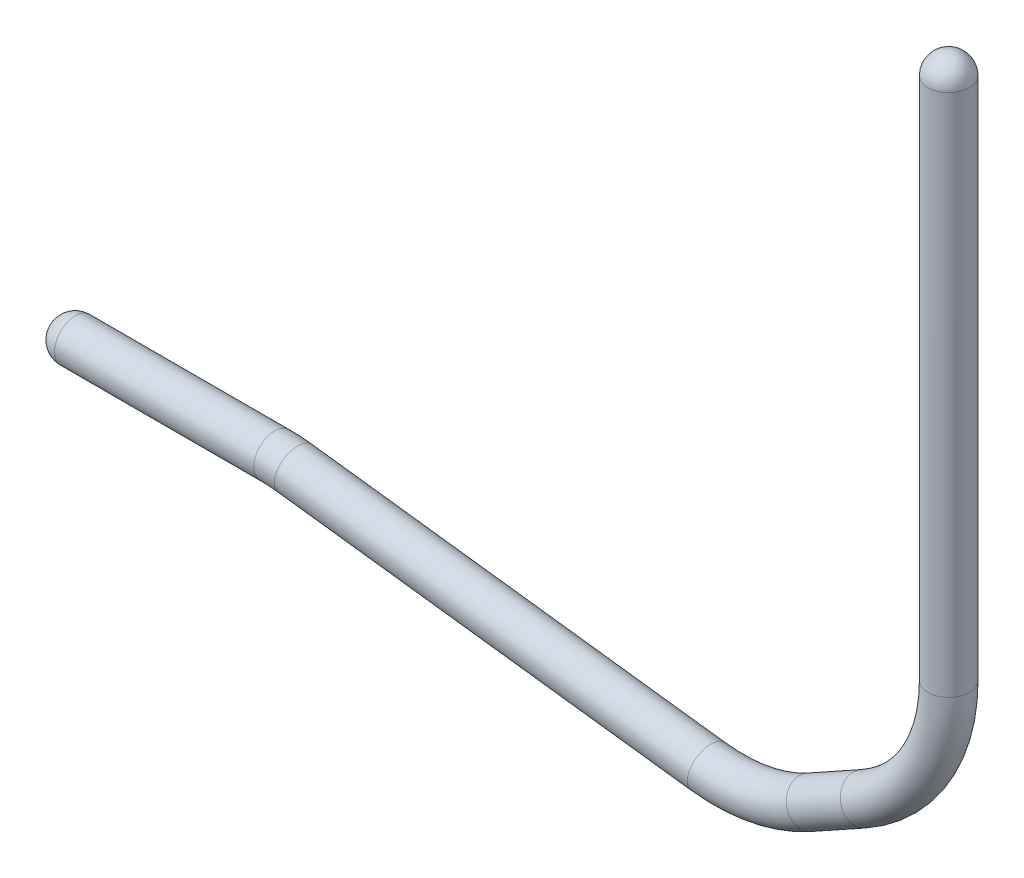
ISO-10303-21;
HEADER;
FILE_DESCRIPTION(('STEP AP214'),'2;1');
FILE_NAME('part.step','',(''),(''),'','','');
FILE_SCHEMA(('AUTOMOTIVE_DESIGN { 1 0 10303 214 1 1 1 1 }'));
ENDSEC;
DATA;
#1=APPLICATION_CONTEXT('core data for automotive mechanical design processes');
#2=APPLICATION_PROTOCOL_DEFINITION('international standard','automotive_design',2000,#1);
#3=PRODUCT_CONTEXT('',#1,'mechanical');
#4=PRODUCT('Part','Part','',(#3));
#5=PRODUCT_RELATED_PRODUCT_CATEGORY('part','',(#4));
#6=PRODUCT_DEFINITION_FORMATION('','',#4);
#7=PRODUCT_DEFINITION_CONTEXT('part definition',#1,'design');
#8=PRODUCT_DEFINITION('design','',#6,#7);
#9=PRODUCT_DEFINITION_SHAPE('','',#8);
#10=(LENGTH_UNIT() NAMED_UNIT(*) SI_UNIT(.MILLI.,.METRE.));
#11=(NAMED_UNIT(*) PLANE_ANGLE_UNIT() SI_UNIT($,.RADIAN.));
#12=(NAMED_UNIT(*) SI_UNIT($,.STERADIAN.) SOLID_ANGLE_UNIT());
#13=UNCERTAINTY_MEASURE_WITH_UNIT(LENGTH_MEASURE(1.E-05),#10,'distance_accuracy_value','');
#14=(GEOMETRIC_REPRESENTATION_CONTEXT(3) GLOBAL_UNCERTAINTY_ASSIGNED_CONTEXT((#13)) GLOBAL_UNIT_ASSIGNED_CONTEXT((#10,
#11,#12)) REPRESENTATION_CONTEXT('',''));
#15=CARTESIAN_POINT('',(0.,0.,0.));
#16=DIRECTION('',(0.,0.,1.));
#17=DIRECTION('',(1.,0.,0.));
#18=AXIS2_PLACEMENT_3D('',#15,#16,#17);
#19=CARTESIAN_POINT('',(0.,-63.1194330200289,0.));
#20=DIRECTION('',(0.,1.,0.));
#21=DIRECTION('',(0.,0.,-1.));
#22=AXIS2_PLACEMENT_3D('',#19,#20,#21);
#23=CYLINDRICAL_SURFACE('',#22,2.5);
#24=CARTESIAN_POINT('',(0.,0.,0.));
#25=DIRECTION('',(0.,1.,0.));
#26=DIRECTION('',(-1.,0.,0.));
#27=AXIS2_PLACEMENT_3D('',#24,#25,#26);
#28=CIRCLE('',#27,2.5);
#29=CARTESIAN_POINT('',(0.,0.,-2.5));
#30=VERTEX_POINT('',#29);
#31=CARTESIAN_POINT('',(0.,0.,2.5));
#32=VERTEX_POINT('',#31);
#33=EDGE_CURVE('E59',#30,#32,#28,.T.);
#34=ORIENTED_EDGE('',*,*,#33,.F.);
#35=CARTESIAN_POINT('',(0.,0.,0.));
#36=DIRECTION('',(0.,-1.,0.));
#37=DIRECTION('',(1.,0.,0.));
#38=AXIS2_PLACEMENT_3D('',#35,#36,#37);
#39=CIRCLE('',#38,2.5);
#40=EDGE_CURVE('E37',#30,#32,#39,.T.);
#41=ORIENTED_EDGE('',*,*,#40,.T.);
#42=EDGE_LOOP('',(#34,#41));
#43=FACE_BOUND('',#42,.T.);
#44=CARTESIAN_POINT('',(0.,-63.1194330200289,0.));
#45=DIRECTION('',(0.,-1.,0.));
#46=DIRECTION('',(1.,0.,0.));
#47=AXIS2_PLACEMENT_3D('',#44,#45,#46);
#48=CIRCLE('',#47,2.5);
#49=CARTESIAN_POINT('',(2.5,-63.1194330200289,0.));
#50=VERTEX_POINT('',#49);
#51=EDGE_CURVE('E11',#50,#50,#48,.T.);
#52=ORIENTED_EDGE('',*,*,#51,.F.);
#53=EDGE_LOOP('',(#52));
#54=FACE_BOUND('',#53,.T.);
#55=ADVANCED_FACE('F16',(#43,#54),#23,.T.);
#56=CARTESIAN_POINT('',(-20.,-63.1194330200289,0.));
#57=DIRECTION('',(0.,0.,-1.));
#58=DIRECTION('',(1.,0.,0.));
#59=AXIS2_PLACEMENT_3D('',#56,#57,#58);
#60=TOROIDAL_SURFACE('',#59,20.,2.5);
#61=CARTESIAN_POINT('',(-10.2871413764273,-80.6025785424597,0.));
#62=DIRECTION('',(-0.874157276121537,-0.485642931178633,0.));
#63=DIRECTION('',(-0.485642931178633,0.874157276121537,0.));
#64=AXIS2_PLACEMENT_3D('',#61,#62,#63);
#65=CIRCLE('',#64,2.5);
#66=CARTESIAN_POINT('',(-9.07303404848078,-82.7879717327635,0.));
#67=VERTEX_POINT('',#66);
#68=EDGE_CURVE('E24',#67,#67,#65,.T.);
#69=CARTESIAN_POINT('',(-20.,-63.1194330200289,0.));
#70=DIRECTION('',(0.,0.,-1.));
#71=DIRECTION('',(1.,0.,0.));
#72=AXIS2_PLACEMENT_3D('',#69,#70,#71);
#73=CIRCLE('',#72,22.5);
#74=EDGE_CURVE('',#50,#67,#73,.T.);
#75=ORIENTED_EDGE('',*,*,#51,.T.);
#76=ORIENTED_EDGE('',*,*,#68,.F.);
#77=ORIENTED_EDGE('',*,*,#74,.T.);
#78=ORIENTED_EDGE('',*,*,#74,.F.);
#79=EDGE_LOOP('',(#75,#77,#76,#78));
#80=FACE_BOUND('',#79,.T.);
#81=ADVANCED_FACE('F91',(#80),#60,.T.);
#82=CARTESIAN_POINT('',(-16.7890684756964,-84.2147602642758,0.));
#83=DIRECTION('',(0.874157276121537,0.485642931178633,0.));
#84=DIRECTION('',(0.,0.,-1.));
#85=AXIS2_PLACEMENT_3D('',#82,#83,#84);
#86=CYLINDRICAL_SURFACE('',#85,2.5);
#87=ORIENTED_EDGE('',*,*,#68,.T.);
#88=EDGE_LOOP('',(#87));
#89=FACE_BOUND('',#88,.T.);
#90=CARTESIAN_POINT('',(-16.7890684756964,-84.2147602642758,0.));
#91=DIRECTION('',(-0.874157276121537,-0.485642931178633,0.));
#92=DIRECTION('',(-0.485642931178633,0.874157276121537,0.));
#93=AXIS2_PLACEMENT_3D('',#90,#91,#92);
#94=CIRCLE('',#93,2.5);
#95=CARTESIAN_POINT('',(-15.5749611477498,-86.4001534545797,0.));
#96=VERTEX_POINT('',#95);
#97=EDGE_CURVE('E75',#96,#96,#94,.T.);
#98=ORIENTED_EDGE('',*,*,#97,.F.);
#99=EDGE_LOOP('',(#98));
#100=FACE_BOUND('',#99,.T.);
#101=ADVANCED_FACE('F88',(#89,#100),#86,.T.);
#102=CARTESIAN_POINT('',(-26.501927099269,-66.7316147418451,0.));
#103=DIRECTION('',(0.,0.,-1.));
#104=DIRECTION('',(1.,0.,0.));
#105=AXIS2_PLACEMENT_3D('',#102,#103,#104);
#106=TOROIDAL_SURFACE('',#105,20.,2.5);
#107=CARTESIAN_POINT('',(-28.9826217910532,-86.5771722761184,0.));
#108=DIRECTION('',(-0.992277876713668,0.124034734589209,0.));
#109=DIRECTION('',(0.124034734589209,0.992277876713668,0.));
#110=AXIS2_PLACEMENT_3D('',#107,#108,#109);
#111=CIRCLE('',#110,2.5);
#112=CARTESIAN_POINT('',(-29.2927086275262,-89.0578669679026,0.));
#113=VERTEX_POINT('',#112);
#114=EDGE_CURVE('E71',#113,#113,#111,.T.);
#115=CARTESIAN_POINT('',(-26.501927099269,-66.7316147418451,0.));
#116=DIRECTION('',(0.,0.,-1.));
#117=DIRECTION('',(1.,0.,0.));
#118=AXIS2_PLACEMENT_3D('',#115,#116,#117);
#119=CIRCLE('',#118,22.5);
#120=EDGE_CURVE('',#96,#113,#119,.T.);
#121=ORIENTED_EDGE('',*,*,#97,.T.);
#122=ORIENTED_EDGE('',*,*,#114,.F.);
#123=ORIENTED_EDGE('',*,*,#120,.T.);
#124=ORIENTED_EDGE('',*,*,#120,.F.);
#125=EDGE_LOOP('',(#121,#123,#122,#124));
#126=FACE_BOUND('',#125,.T.);
#127=ADVANCED_FACE('F99',(#126),#106,.T.);
#128=CARTESIAN_POINT('',(-78.7644602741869,-80.3544424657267,0.));
#129=DIRECTION('',(0.992277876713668,-0.124034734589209,0.));
#130=DIRECTION('',(0.,0.,-1.));
#131=AXIS2_PLACEMENT_3D('',#128,#129,#130);
#132=CYLINDRICAL_SURFACE('',#131,2.5);
#133=ORIENTED_EDGE('',*,*,#114,.T.);
#134=EDGE_LOOP('',(#133));
#135=FACE_BOUND('',#134,.T.);
#136=CARTESIAN_POINT('',(-78.7644602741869,-80.3544424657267,0.));
#137=DIRECTION('',(-0.992277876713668,0.124034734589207,0.));
#138=DIRECTION('',(0.124034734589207,0.992277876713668,0.));
#139=AXIS2_PLACEMENT_3D('',#136,#137,#138);
#140=CIRCLE('',#139,2.5);
#141=CARTESIAN_POINT('',(-78.4543734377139,-77.8737477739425,0.));
#142=VERTEX_POINT('',#141);
#143=EDGE_CURVE('E67',#142,#142,#140,.T.);
#144=ORIENTED_EDGE('',*,*,#143,.F.);
#145=EDGE_LOOP('',(#144));
#146=FACE_BOUND('',#145,.T.);
#147=ADVANCED_FACE('F104',(#135,#146),#132,.T.);
#148=CARTESIAN_POINT('',(-81.245154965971,-100.2,0.));
#149=DIRECTION('',(0.,0.,1.));
#150=DIRECTION('',(-1.,0.,0.));
#151=AXIS2_PLACEMENT_3D('',#148,#149,#150);
#152=TOROIDAL_SURFACE('',#151,20.,2.5);
#153=CARTESIAN_POINT('',(-81.245154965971,-80.2,0.));
#154=DIRECTION('',(-1.,0.,0.));
#155=DIRECTION('',(0.,1.,0.));
#156=AXIS2_PLACEMENT_3D('',#153,#154,#155);
#157=CIRCLE('',#156,2.5);
#158=CARTESIAN_POINT('',(-81.245154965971,-77.7,0.));
#159=VERTEX_POINT('',#158);
#160=EDGE_CURVE('E64',#159,#159,#157,.T.);
#161=CARTESIAN_POINT('',(-81.245154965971,-100.2,0.));
#162=DIRECTION('',(0.,0.,1.));
#163=DIRECTION('',(-1.,0.,0.));
#164=AXIS2_PLACEMENT_3D('',#161,#162,#163);
#165=CIRCLE('',#164,22.5);
#166=EDGE_CURVE('',#142,#159,#165,.T.);
#167=ORIENTED_EDGE('',*,*,#143,.T.);
#168=ORIENTED_EDGE('',*,*,#160,.F.);
#169=ORIENTED_EDGE('',*,*,#166,.T.);
#170=ORIENTED_EDGE('',*,*,#166,.F.);
#171=EDGE_LOOP('',(#167,#169,#168,#170));
#172=FACE_BOUND('',#171,.T.);
#173=ADVANCED_FACE('F108',(#172),#152,.T.);
#174=CARTESIAN_POINT('',(-105.2625,-80.2,0.));
#175=DIRECTION('',(1.,0.,0.));
#176=DIRECTION('',(0.,0.,-1.));
#177=AXIS2_PLACEMENT_3D('',#174,#175,#176);
#178=CYLINDRICAL_SURFACE('',#177,2.49999999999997);
#179=ORIENTED_EDGE('',*,*,#160,.T.);
#180=EDGE_LOOP('',(#179));
#181=FACE_BOUND('',#180,.T.);
#182=CARTESIAN_POINT('',(-105.2625,-80.2,0.));
#183=DIRECTION('',(-1.,0.,0.));
#184=DIRECTION('',(0.,-1.,0.));
#185=AXIS2_PLACEMENT_3D('',#182,#183,#184);
#186=CIRCLE('',#185,2.5);
#187=CARTESIAN_POINT('',(-105.2625,-80.2,-2.49999999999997));
#188=VERTEX_POINT('',#187);
#189=CARTESIAN_POINT('',(-105.2625,-80.2,2.5));
#190=VERTEX_POINT('',#189);
#191=EDGE_CURVE('E44',#188,#190,#186,.T.);
#192=ORIENTED_EDGE('',*,*,#191,.F.);
#193=CARTESIAN_POINT('',(-105.2625,-80.2,0.));
#194=DIRECTION('',(1.,0.,0.));
#195=DIRECTION('',(0.,1.,0.));
#196=AXIS2_PLACEMENT_3D('',#193,#194,#195);
#197=CIRCLE('',#196,2.5);
#198=EDGE_CURVE('E30',#188,#190,#197,.T.);
#199=ORIENTED_EDGE('',*,*,#198,.T.);
#200=EDGE_LOOP('',(#192,#199));
#201=FACE_BOUND('',#200,.T.);
#202=ADVANCED_FACE('F43',(#181,#201),#178,.T.);
#203=CARTESIAN_POINT('',(0.,0.,0.));
#204=DIRECTION('',(0.,0.,1.));
#205=DIRECTION('',(1.,0.,0.));
#206=AXIS2_PLACEMENT_3D('',#203,#204,#205);
#207=SPHERICAL_SURFACE('',#206,2.5);
#208=CARTESIAN_POINT('',(0.,0.,0.));
#209=DIRECTION('',(0.,1.,0.));
#210=DIRECTION('',(-1.,0.,0.));
#211=AXIS2_PLACEMENT_3D('',#208,#209,#210);
#212=SPHERICAL_SURFACE('',#211,2.5);
#213=ORIENTED_EDGE('',*,*,#33,.T.);
#214=ORIENTED_EDGE('',*,*,#40,.F.);
#215=EDGE_LOOP('',(#213,#214));
#216=FACE_BOUND('',#215,.T.);
#217=ADVANCED_FACE('F115',(#216),#212,.T.);
#218=CARTESIAN_POINT('',(-105.2625,-80.2,0.));
#219=DIRECTION('',(0.,0.,1.));
#220=DIRECTION('',(0.,1.,0.));
#221=AXIS2_PLACEMENT_3D('',#218,#219,#220);
#222=SPHERICAL_SURFACE('',#221,2.5);
#223=CARTESIAN_POINT('',(-105.2625,-80.2,0.));
#224=DIRECTION('',(-1.,0.,0.));
#225=DIRECTION('',(0.,-1.,0.));
#226=AXIS2_PLACEMENT_3D('',#223,#224,#225);
#227=SPHERICAL_SURFACE('',#226,2.5);
#228=ORIENTED_EDGE('',*,*,#191,.T.);
#229=ORIENTED_EDGE('',*,*,#198,.F.);
#230=EDGE_LOOP('',(#228,#229));
#231=FACE_BOUND('',#230,.T.);
#232=ADVANCED_FACE('F47',(#231),#227,.T.);
#233=CLOSED_SHELL('',(#55,#81,#101,#127,#147,#173,#202,#217,#232));
#234=MANIFOLD_SOLID_BREP('B1',#233);
#235=ADVANCED_BREP_SHAPE_REPRESENTATION('',(#18,#234),#14);
#236=SHAPE_DEFINITION_REPRESENTATION(#9,#235);
ENDSEC;
END-ISO-10303-21;
